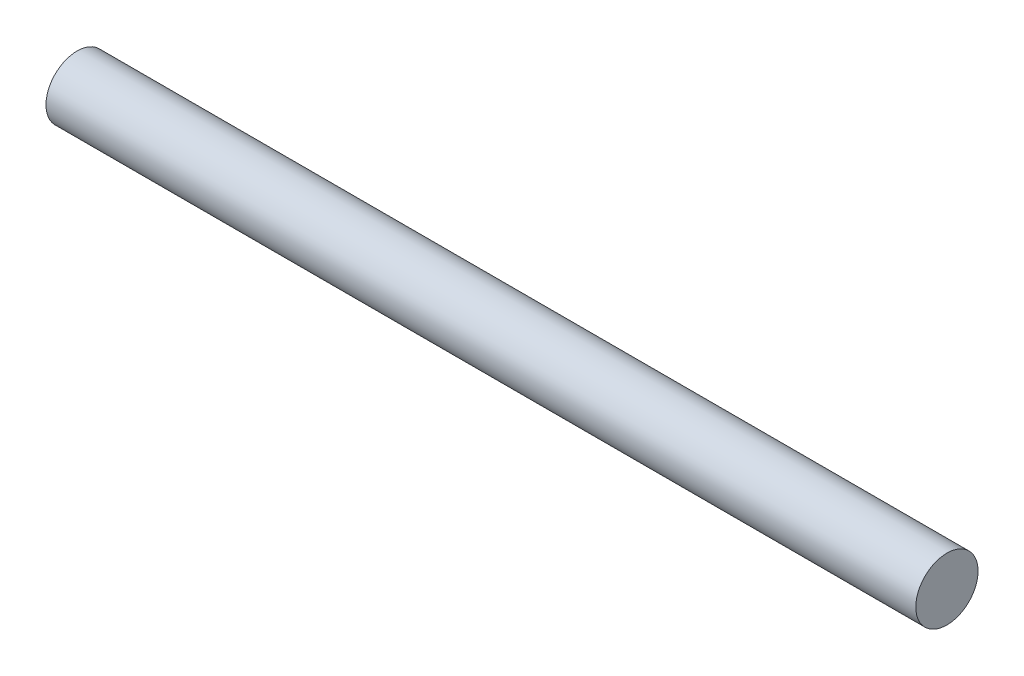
ISO-10303-21;
HEADER;
FILE_DESCRIPTION(('STEP AP214'),'2;1');
FILE_NAME('part.step','',(''),(''),'','','');
FILE_SCHEMA(('AUTOMOTIVE_DESIGN { 1 0 10303 214 1 1 1 1 }'));
ENDSEC;
DATA;
#1=APPLICATION_CONTEXT('core data for automotive mechanical design processes');
#2=APPLICATION_PROTOCOL_DEFINITION('international standard','automotive_design',2000,#1);
#3=PRODUCT_CONTEXT('',#1,'mechanical');
#4=PRODUCT('Part','Part','',(#3));
#5=PRODUCT_RELATED_PRODUCT_CATEGORY('part','',(#4));
#6=PRODUCT_DEFINITION_FORMATION('','',#4);
#7=PRODUCT_DEFINITION_CONTEXT('part definition',#1,'design');
#8=PRODUCT_DEFINITION('design','',#6,#7);
#9=PRODUCT_DEFINITION_SHAPE('','',#8);
#10=(LENGTH_UNIT() NAMED_UNIT(*) SI_UNIT(.MILLI.,.METRE.));
#11=(NAMED_UNIT(*) PLANE_ANGLE_UNIT() SI_UNIT($,.RADIAN.));
#12=(NAMED_UNIT(*) SI_UNIT($,.STERADIAN.) SOLID_ANGLE_UNIT());
#13=UNCERTAINTY_MEASURE_WITH_UNIT(LENGTH_MEASURE(1.E-05),#10,'distance_accuracy_value','');
#14=(GEOMETRIC_REPRESENTATION_CONTEXT(3) GLOBAL_UNCERTAINTY_ASSIGNED_CONTEXT((#13)) GLOBAL_UNIT_ASSIGNED_CONTEXT((#10,
#11,#12)) REPRESENTATION_CONTEXT('',''));
#15=CARTESIAN_POINT('',(0.,0.,0.));
#16=DIRECTION('',(0.,0.,1.));
#17=DIRECTION('',(1.,0.,0.));
#18=AXIS2_PLACEMENT_3D('',#15,#16,#17);
#19=CARTESIAN_POINT('',(-111.972453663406,0.315734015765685,0.));
#20=DIRECTION('',(1.,0.,0.));
#21=DIRECTION('',(0.,0.,1.));
#22=AXIS2_PLACEMENT_3D('',#19,#20,#21);
#23=PLANE('',#22);
#24=CARTESIAN_POINT('',(-111.972453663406,0.860159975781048,0.));
#25=DIRECTION('',(-1.,0.,0.));
#26=DIRECTION('',(0.,0.,1.));
#27=AXIS2_PLACEMENT_3D('',#24,#25,#26);
#28=CIRCLE('',#27,0.544425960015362);
#29=CARTESIAN_POINT('',(-111.972453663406,0.860159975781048,0.544425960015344));
#30=VERTEX_POINT('',#29);
#31=EDGE_CURVE('E35',#30,#30,#28,.T.);
#32=ORIENTED_EDGE('',*,*,#31,.F.);
#33=EDGE_LOOP('',(#32));
#34=FACE_BOUND('',#33,.T.);
#35=ADVANCED_FACE('F29',(#34),#23,.T.);
#36=CARTESIAN_POINT('',(-127.176989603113,0.315734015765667,0.));
#37=DIRECTION('',(-1.,0.,0.));
#38=DIRECTION('',(0.,0.,-1.));
#39=AXIS2_PLACEMENT_3D('',#36,#37,#38);
#40=PLANE('',#39);
#41=CARTESIAN_POINT('',(-127.176989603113,0.860159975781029,0.));
#42=DIRECTION('',(-1.,0.,0.));
#43=DIRECTION('',(0.,0.,1.));
#44=AXIS2_PLACEMENT_3D('',#41,#42,#43);
#45=CIRCLE('',#44,0.544425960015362);
#46=CARTESIAN_POINT('',(-127.176989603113,0.860159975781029,0.544425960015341));
#47=VERTEX_POINT('',#46);
#48=EDGE_CURVE('E10',#47,#47,#45,.T.);
#49=ORIENTED_EDGE('',*,*,#48,.T.);
#50=EDGE_LOOP('',(#49));
#51=FACE_BOUND('',#50,.T.);
#52=ADVANCED_FACE('F44',(#51),#40,.T.);
#53=CARTESIAN_POINT('',(-111.712794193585,0.860159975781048,0.));
#54=DIRECTION('',(1.,0.,0.));
#55=DIRECTION('',(0.,0.,1.));
#56=AXIS2_PLACEMENT_3D('',#53,#54,#55);
#57=CYLINDRICAL_SURFACE('',#56,0.544425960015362);
#58=ORIENTED_EDGE('',*,*,#48,.F.);
#59=EDGE_LOOP('',(#58));
#60=FACE_BOUND('',#59,.T.);
#61=ORIENTED_EDGE('',*,*,#31,.T.);
#62=EDGE_LOOP('',(#61));
#63=FACE_BOUND('',#62,.T.);
#64=ADVANCED_FACE('F41',(#60,#63),#57,.T.);
#65=CLOSED_SHELL('',(#35,#52,#64));
#66=MANIFOLD_SOLID_BREP('B2',#65);
#67=ADVANCED_BREP_SHAPE_REPRESENTATION('',(#18,#66),#14);
#68=SHAPE_DEFINITION_REPRESENTATION(#9,#67);
ENDSEC;
END-ISO-10303-21;
